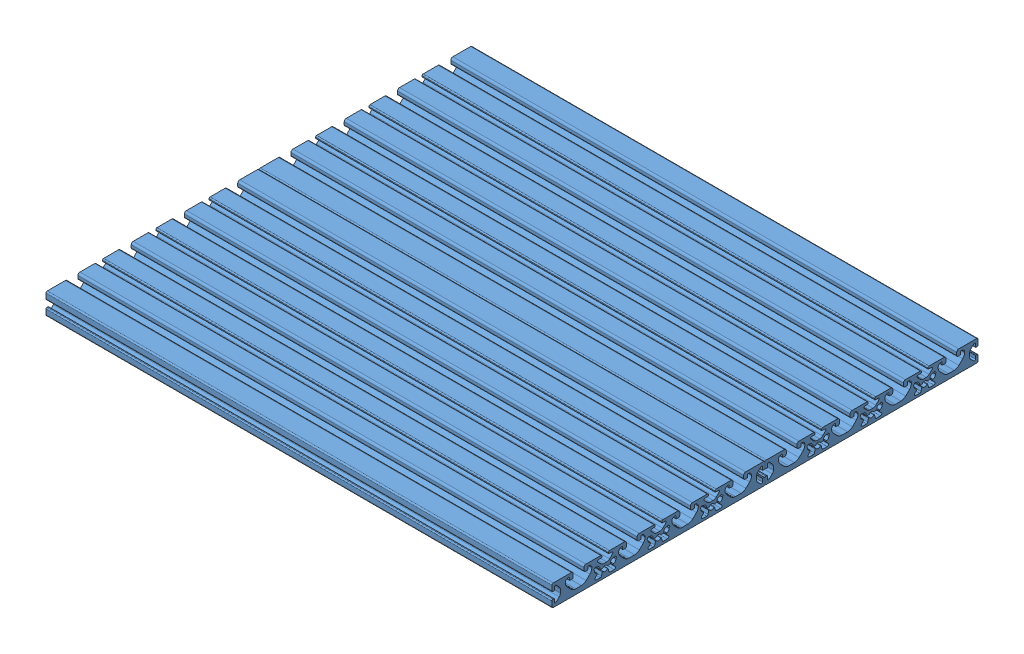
SolidWorks assembly X-Mesa.SLDASM, configuration Predeterminado (file format 3800). Lengths in mm.
Overall size (380 16 320).
2 component instances, 1 part files, 0 mates.
Components (placement in the parent):
- Pervil AL 160x16x380-1: Pervil AL 160x16x380.sldprt [Predeterminado] at (380 0 0) x (0 0 -1) z (-1 0 0) size (160 16 380)
- Pervil AL 160x16x380-2: Pervil AL 160x16x380.sldprt [Predeterminado] x (0 0 1) z (1 0 0) size (160 16 380)
